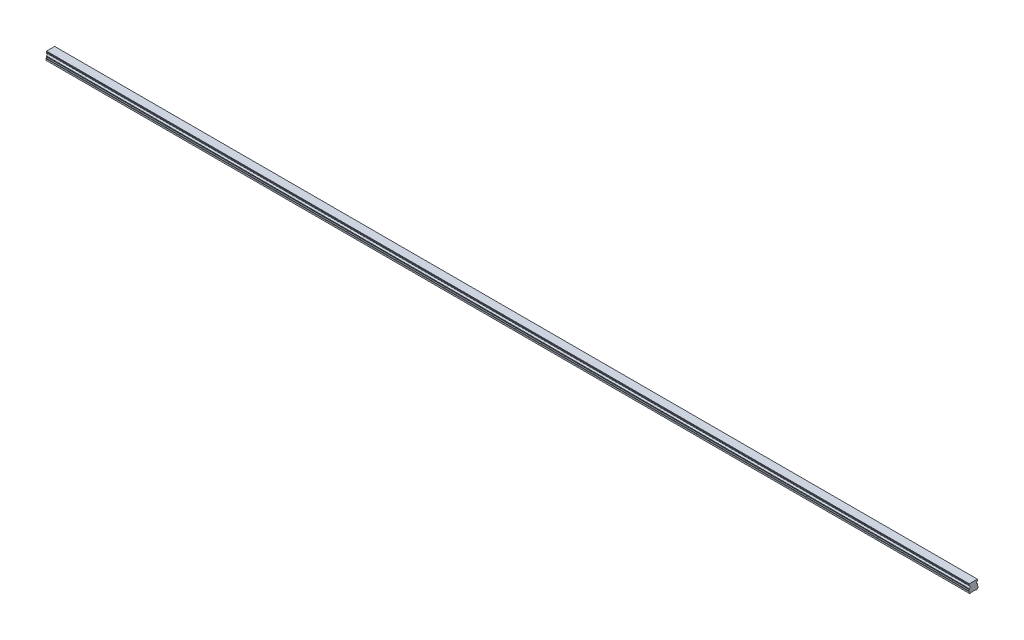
from build123d import *

# Parameters (mm, degrees)
BOSS_EXTRUDE1_DEPTH        = 1500
SKETCH3_R                  = 2.5
SKETCH3_R_2                = 2.1
CUT_EXTRUDE3_DEPTH         = 7
SKETCH3_2_R                = 2.1
CUT_EXTRUDE4_DEPTH         = 9.5
CHAMFER1_SIZE              = 0.4
LPATTERN2_COUNT            = 25
LPATTERN2_PITCH            = 60
CHAMFER1_OF_LPATTERN2_SIZE = 0.4


with BuildPart() as part:
    # Sketch1 → Boss-Extrude1 (new body)
    with BuildSketch(Plane(origin=(0, 0, 0), x_dir=(0, 0, -1), z_dir=(1, 0, 0))):
        with BuildLine():
            Line((6.59, 14), (-6.59, 14))
            Line((-6.59, 14), (-6.59, 13.15))
            Line((-6.59, 13.15), (-6.96, 12.356532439))
            Line((-6.96, 12.356532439), (-6.96, 11.435174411))
            ThreePointArc((-6.96, 11.435174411), (-5.25, 9.5), (-6.96, 7.564825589))
            Line((-6.96, 7.564825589), (-6.96, 6.643467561))
            Line((-6.96, 6.643467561), (-6.59, 5.85))
            Line((-6.59, 5.85), (-7.032116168, 4.2))
            Line((-7.032116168, 4.2), (-7.5, 3.929867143))
            Line((-7.5, 3.929867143), (-7.5, 1.4))
            Line((-7.5, 1.4), (-6.1, 0))
            Line((-6.1, 0), (-3.65, 0))
            Line((-3.65, 0), (-3.25, 0.4))
            Line((-3.25, 0.4), (3.25, 0.4))
            Line((3.25, 0.4), (3.65, 0))
            Line((3.65, 0), (6.1, 0))
            Line((6.1, 0), (7.5, 1.4))
            Line((7.5, 1.4), (7.5, 3.929867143))
            Line((7.5, 3.929867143), (7.032116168, 4.2))
            Line((7.032116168, 4.2), (6.59, 5.85))
            Line((6.59, 5.85), (6.96, 6.643467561))
            Line((6.96, 6.643467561), (6.96, 7.564825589))
            ThreePointArc((6.96, 7.564825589), (5.25, 9.5), (6.96, 11.435174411))
            Line((6.96, 11.435174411), (6.96, 12.356532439))
            Line((6.96, 12.356532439), (6.59, 13.15))
            Line((6.59, 13.15), (6.59, 14))
        make_face()
    extrude(amount=BOSS_EXTRUDE1_DEPTH)

    # Sketch3 → Cut-Extrude3 (cut)
    with BuildSketch(Plane.XZ):
        with Locations(Location((30, 0, 0), (0, 0, 270))):
            Circle(SKETCH3_R)
        with Locations(Location((30, 0, 0), (0, 0, 270))):
            Circle(SKETCH3_R_2, mode=Mode.SUBTRACT)
    cut_extrude3 = extrude(amount=-CUT_EXTRUDE3_DEPTH, mode=Mode.SUBTRACT)

    # Sketch3_2 → Cut-Extrude4 (cut)
    with BuildSketch(Plane.XZ):
        with Locations(Location((30, 0, 0), (0, 0, 270))):
            Circle(SKETCH3_2_R)
    cut_extrude4 = extrude(amount=-CUT_EXTRUDE4_DEPTH, mode=Mode.SUBTRACT)

    # Cut-Extrude5 cone 1 section (on through the dimple's axis) → Cut-Extrude5 (revolve, cut)
    with BuildSketch(Plane(origin=(30, 9.5, 0), x_dir=(0, 0, -1), z_dir=(1, 0, 0))):
        Polygon((0, 0), (2.1, 0), (0, 1.212435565), align=None)
    revolve(axis=Axis((30, 9.5, 0), (0, 1, 0)), mode=Mode.SUBTRACT)

    # Chamfer1
    chamfer1_edges = [part.edges().sort_by_distance(p)[0] for p in [
        (30, 0.4, 2.5),
    ]]
    chamfer(chamfer1_edges, length=CHAMFER1_SIZE)

    # LPattern2: Cut-Extrude3, Cut-Extrude4 ×25
    with Locations(*[(i * LPATTERN2_PITCH, 0, 0) for i in range(1, LPATTERN2_COUNT)]):
        add(cut_extrude3, mode=Mode.SUBTRACT)
        add(cut_extrude4, mode=Mode.SUBTRACT)

    # Chamfer1 of LPattern2
    chamfer1_of_lpattern2_edges = [part.edges().sort_by_distance(p)[0] for p in [
        (90, 0.4, 2.5),
        (150, 0.4, 2.5),
        (210, 0.4, 2.5),
        (270, 0.4, 2.5),
        (330, 0.4, 2.5),
        (390, 0.4, 2.5),
        (450, 0.4, 2.5),
        (510, 0.4, 2.5),
        (570, 0.4, 2.5),
        (630, 0.4, 2.5),
        (690, 0.4, 2.5),
        (750, 0.4, 2.5),
        (810, 0.4, 2.5),
        (870, 0.4, 2.5),
        (930, 0.4, 2.5),
        (990, 0.4, 2.5),
        (1050, 0.4, 2.5),
        (1110, 0.4, 2.5),
        (1170, 0.4, 2.5),
        (1230, 0.4, 2.5),
        (1290, 0.4, 2.5),
        (1350, 0.4, 2.5),
        (1410, 0.4, 2.5),
        (1470, 0.4, 2.5),
    ]]
    chamfer(chamfer1_of_lpattern2_edges, length=CHAMFER1_OF_LPATTERN2_SIZE)


solid = part.part
